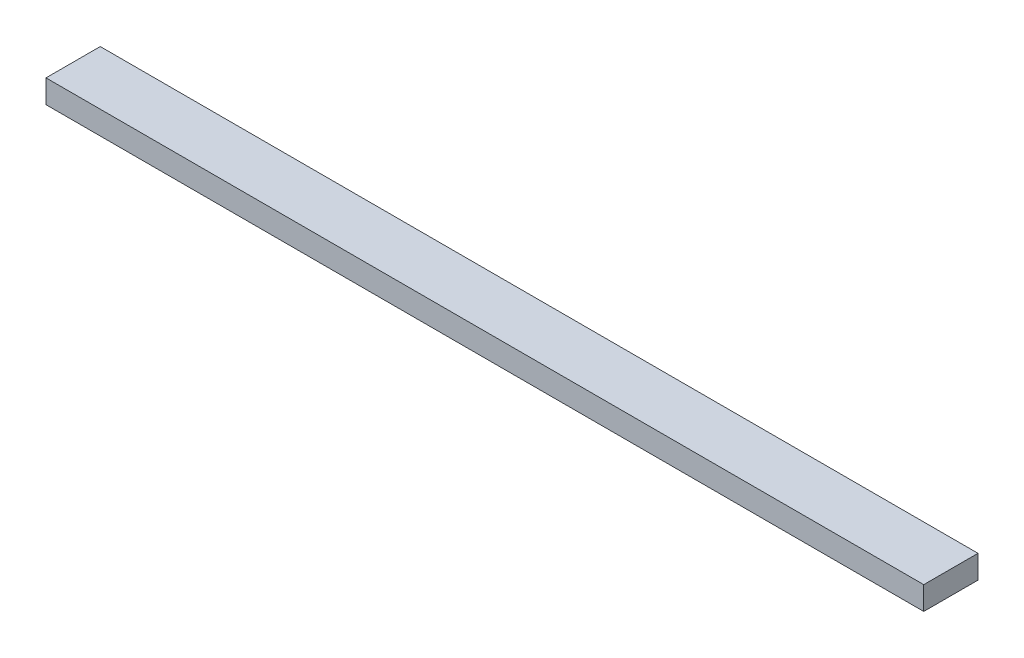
ISO-10303-21;
HEADER;
FILE_DESCRIPTION(('STEP AP214'),'2;1');
FILE_NAME('part.step','',(''),(''),'','','');
FILE_SCHEMA(('AUTOMOTIVE_DESIGN { 1 0 10303 214 1 1 1 1 }'));
ENDSEC;
DATA;
#1=APPLICATION_CONTEXT('core data for automotive mechanical design processes');
#2=APPLICATION_PROTOCOL_DEFINITION('international standard','automotive_design',2000,#1);
#3=PRODUCT_CONTEXT('',#1,'mechanical');
#4=PRODUCT('Part','Part','',(#3));
#5=PRODUCT_RELATED_PRODUCT_CATEGORY('part','',(#4));
#6=PRODUCT_DEFINITION_FORMATION('','',#4);
#7=PRODUCT_DEFINITION_CONTEXT('part definition',#1,'design');
#8=PRODUCT_DEFINITION('design','',#6,#7);
#9=PRODUCT_DEFINITION_SHAPE('','',#8);
#10=(LENGTH_UNIT() NAMED_UNIT(*) SI_UNIT(.MILLI.,.METRE.));
#11=(NAMED_UNIT(*) PLANE_ANGLE_UNIT() SI_UNIT($,.RADIAN.));
#12=(NAMED_UNIT(*) SI_UNIT($,.STERADIAN.) SOLID_ANGLE_UNIT());
#13=UNCERTAINTY_MEASURE_WITH_UNIT(LENGTH_MEASURE(1.E-05),#10,'distance_accuracy_value','');
#14=(GEOMETRIC_REPRESENTATION_CONTEXT(3) GLOBAL_UNCERTAINTY_ASSIGNED_CONTEXT((#13)) GLOBAL_UNIT_ASSIGNED_CONTEXT((#10,
#11,#12)) REPRESENTATION_CONTEXT('',''));
#15=CARTESIAN_POINT('',(0.,0.,0.));
#16=DIRECTION('',(0.,0.,1.));
#17=DIRECTION('',(1.,0.,0.));
#18=AXIS2_PLACEMENT_3D('',#15,#16,#17);
#19=CARTESIAN_POINT('',(1438.275,0.,0.));
#20=DIRECTION('',(0.,0.,-1.));
#21=DIRECTION('',(-1.,0.,0.));
#22=AXIS2_PLACEMENT_3D('',#19,#20,#21);
#23=PLANE('',#22);
#24=DIRECTION('',(0.,-1.,0.));
#25=VECTOR('',#24,1.);
#26=CARTESIAN_POINT('',(0.,0.,0.));
#27=LINE('',#26,#25);
#28=CARTESIAN_POINT('',(0.,38.1,0.));
#29=VERTEX_POINT('',#28);
#30=CARTESIAN_POINT('',(0.,0.,0.));
#31=VERTEX_POINT('',#30);
#32=EDGE_CURVE('E105',#29,#31,#27,.T.);
#33=ORIENTED_EDGE('',*,*,#32,.T.);
#34=DIRECTION('',(-1.,0.,0.));
#35=VECTOR('',#34,1.);
#36=CARTESIAN_POINT('',(1438.275,0.,0.));
#37=LINE('',#36,#35);
#38=CARTESIAN_POINT('',(1438.275,0.,0.));
#39=VERTEX_POINT('',#38);
#40=EDGE_CURVE('E11',#39,#31,#37,.T.);
#41=ORIENTED_EDGE('',*,*,#40,.F.);
#42=DIRECTION('',(0.,-1.,0.));
#43=VECTOR('',#42,1.);
#44=CARTESIAN_POINT('',(1438.275,0.,0.));
#45=LINE('',#44,#43);
#46=CARTESIAN_POINT('',(1438.275,38.1,0.));
#47=VERTEX_POINT('',#46);
#48=EDGE_CURVE('E88',#47,#39,#45,.T.);
#49=ORIENTED_EDGE('',*,*,#48,.F.);
#50=DIRECTION('',(-1.,0.,0.));
#51=VECTOR('',#50,1.);
#52=CARTESIAN_POINT('',(1438.275,38.1,0.));
#53=LINE('',#52,#51);
#54=EDGE_CURVE('E101',#47,#29,#53,.T.);
#55=ORIENTED_EDGE('',*,*,#54,.T.);
#56=EDGE_LOOP('',(#33,#41,#49,#55));
#57=FACE_BOUND('',#56,.T.);
#58=ADVANCED_FACE('F36',(#57),#23,.F.);
#59=CARTESIAN_POINT('',(1438.275,0.,0.));
#60=DIRECTION('',(0.,1.,0.));
#61=DIRECTION('',(0.,0.,1.));
#62=AXIS2_PLACEMENT_3D('',#59,#60,#61);
#63=PLANE('',#62);
#64=DIRECTION('',(0.,0.,-1.));
#65=VECTOR('',#64,1.);
#66=CARTESIAN_POINT('',(0.,0.,0.));
#67=LINE('',#66,#65);
#68=CARTESIAN_POINT('',(0.,0.,-88.9));
#69=VERTEX_POINT('',#68);
#70=EDGE_CURVE('E93',#31,#69,#67,.T.);
#71=ORIENTED_EDGE('',*,*,#70,.T.);
#72=DIRECTION('',(-1.,0.,0.));
#73=VECTOR('',#72,1.);
#74=CARTESIAN_POINT('',(1438.275,0.,-88.9));
#75=LINE('',#74,#73);
#76=CARTESIAN_POINT('',(1438.275,0.,-88.9));
#77=VERTEX_POINT('',#76);
#78=EDGE_CURVE('E45',#77,#69,#75,.T.);
#79=ORIENTED_EDGE('',*,*,#78,.F.);
#80=DIRECTION('',(0.,0.,-1.));
#81=VECTOR('',#80,1.);
#82=CARTESIAN_POINT('',(1438.275,0.,0.));
#83=LINE('',#82,#81);
#84=EDGE_CURVE('E83',#39,#77,#83,.T.);
#85=ORIENTED_EDGE('',*,*,#84,.F.);
#86=ORIENTED_EDGE('',*,*,#40,.T.);
#87=EDGE_LOOP('',(#71,#79,#85,#86));
#88=FACE_BOUND('',#87,.T.);
#89=ADVANCED_FACE('F92',(#88),#63,.F.);
#90=CARTESIAN_POINT('',(1438.275,0.,-88.9));
#91=DIRECTION('',(0.,0.,1.));
#92=DIRECTION('',(1.,0.,0.));
#93=AXIS2_PLACEMENT_3D('',#90,#91,#92);
#94=PLANE('',#93);
#95=DIRECTION('',(0.,1.,0.));
#96=VECTOR('',#95,1.);
#97=CARTESIAN_POINT('',(0.,0.,-88.9));
#98=LINE('',#97,#96);
#99=CARTESIAN_POINT('',(0.,38.1,-88.9));
#100=VERTEX_POINT('',#99);
#101=EDGE_CURVE('E70',#69,#100,#98,.T.);
#102=ORIENTED_EDGE('',*,*,#101,.T.);
#103=DIRECTION('',(-1.,0.,0.));
#104=VECTOR('',#103,1.);
#105=CARTESIAN_POINT('',(1438.275,38.1,-88.9));
#106=LINE('',#105,#104);
#107=CARTESIAN_POINT('',(1438.275,38.1,-88.9));
#108=VERTEX_POINT('',#107);
#109=EDGE_CURVE('E95',#108,#100,#106,.T.);
#110=ORIENTED_EDGE('',*,*,#109,.F.);
#111=DIRECTION('',(0.,1.,0.));
#112=VECTOR('',#111,1.);
#113=CARTESIAN_POINT('',(1438.275,0.,-88.9));
#114=LINE('',#113,#112);
#115=EDGE_CURVE('E86',#77,#108,#114,.T.);
#116=ORIENTED_EDGE('',*,*,#115,.F.);
#117=ORIENTED_EDGE('',*,*,#78,.T.);
#118=EDGE_LOOP('',(#102,#110,#116,#117));
#119=FACE_BOUND('',#118,.T.);
#120=ADVANCED_FACE('F96',(#119),#94,.F.);
#121=CARTESIAN_POINT('',(1438.275,38.1,0.));
#122=DIRECTION('',(0.,-1.,0.));
#123=DIRECTION('',(0.,0.,-1.));
#124=AXIS2_PLACEMENT_3D('',#121,#122,#123);
#125=PLANE('',#124);
#126=DIRECTION('',(0.,0.,1.));
#127=VECTOR('',#126,1.);
#128=CARTESIAN_POINT('',(0.,38.1,0.));
#129=LINE('',#128,#127);
#130=EDGE_CURVE('E76',#100,#29,#129,.T.);
#131=ORIENTED_EDGE('',*,*,#130,.T.);
#132=ORIENTED_EDGE('',*,*,#54,.F.);
#133=DIRECTION('',(0.,0.,1.));
#134=VECTOR('',#133,1.);
#135=CARTESIAN_POINT('',(1438.275,38.1,0.));
#136=LINE('',#135,#134);
#137=EDGE_CURVE('E53',#108,#47,#136,.T.);
#138=ORIENTED_EDGE('',*,*,#137,.F.);
#139=ORIENTED_EDGE('',*,*,#109,.T.);
#140=EDGE_LOOP('',(#131,#132,#138,#139));
#141=FACE_BOUND('',#140,.T.);
#142=ADVANCED_FACE('F119',(#141),#125,.F.);
#143=CARTESIAN_POINT('',(1438.275,0.,0.));
#144=DIRECTION('',(-1.,0.,0.));
#145=DIRECTION('',(0.,0.,1.));
#146=AXIS2_PLACEMENT_3D('',#143,#144,#145);
#147=PLANE('',#146);
#148=ORIENTED_EDGE('',*,*,#48,.T.);
#149=ORIENTED_EDGE('',*,*,#84,.T.);
#150=ORIENTED_EDGE('',*,*,#115,.T.);
#151=ORIENTED_EDGE('',*,*,#137,.T.);
#152=EDGE_LOOP('',(#148,#149,#150,#151));
#153=FACE_BOUND('',#152,.T.);
#154=ADVANCED_FACE('F84',(#153),#147,.F.);
#155=CARTESIAN_POINT('',(0.,0.,0.));
#156=DIRECTION('',(-1.,0.,0.));
#157=DIRECTION('',(0.,0.,1.));
#158=AXIS2_PLACEMENT_3D('',#155,#156,#157);
#159=PLANE('',#158);
#160=ORIENTED_EDGE('',*,*,#32,.F.);
#161=ORIENTED_EDGE('',*,*,#130,.F.);
#162=ORIENTED_EDGE('',*,*,#101,.F.);
#163=ORIENTED_EDGE('',*,*,#70,.F.);
#164=EDGE_LOOP('',(#160,#161,#162,#163));
#165=FACE_BOUND('',#164,.T.);
#166=ADVANCED_FACE('F122',(#165),#159,.T.);
#167=CLOSED_SHELL('',(#58,#89,#120,#142,#154,#166));
#168=MANIFOLD_SOLID_BREP('B2',#167);
#169=ADVANCED_BREP_SHAPE_REPRESENTATION('',(#18,#168),#14);
#170=SHAPE_DEFINITION_REPRESENTATION(#9,#169);
ENDSEC;
END-ISO-10303-21;
